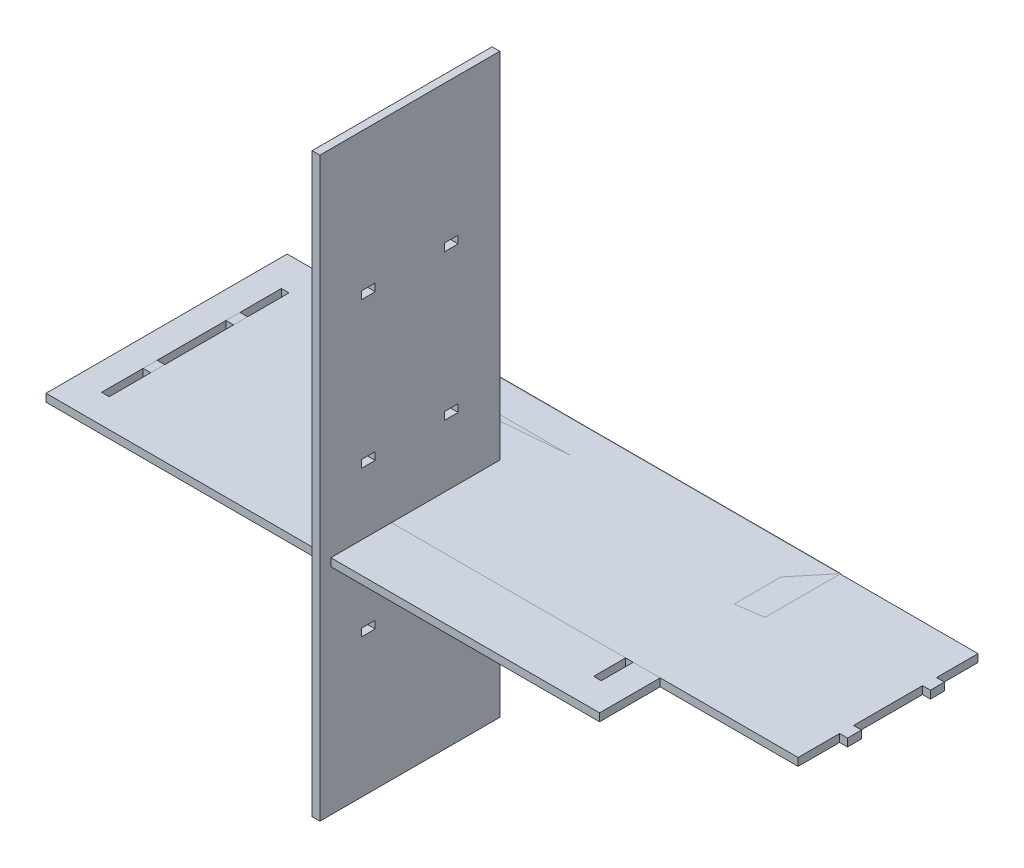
from build123d import *

# Parameters (mm, degrees)
SCHIZZO4_W                   = 130
SCHIZZO4_H                   = 416.834015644
SCHIZZO4_W_2                 = 9.9
SCHIZZO4_H_2                 = 5.5
ESTRUSIONE_ESTRUSIONE1_DEPTH = 5.6
ESTRUSIONE_ESTRUSIONE2_DEPTH = 5.6
ESTRUSIONE_ESTRUSIONE3_DEPTH = 5.6
SCHIZZO8_W                   = 400
SCHIZZO8_H                   = 174.270709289
SCHIZZO8_W_2                 = 350
SCHIZZO8_H_2                 = 129.9
ESTRUSIONE_ESTRUSIONE4_DEPTH = 5.6


with BuildPart() as part:
    # Schizzo4 → Estrusione-Estrusione1 (new body)
    with BuildSketch(Plane(origin=(0, 0, 0), x_dir=(0, 0, -1), z_dir=(1, 0, 0))):
        with Locations((-28.579812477, 53.046202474)):
            Rectangle(SCHIZZO4_W, SCHIZZO4_H)
        with Locations((1.370187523, 158.713210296)):
            Rectangle(SCHIZZO4_W_2, SCHIZZO4_H_2, mode=Mode.SUBTRACT)
        with Locations((-58.529812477, 158.713210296)):
            Rectangle(SCHIZZO4_W_2, SCHIZZO4_H_2, mode=Mode.SUBTRACT)
        with Locations((1.370187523, 53.213210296)):
            Rectangle(SCHIZZO4_W_2, SCHIZZO4_H_2, mode=Mode.SUBTRACT)
        with Locations((-58.529812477, 53.213210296)):
            Rectangle(SCHIZZO4_W_2, SCHIZZO4_H_2, mode=Mode.SUBTRACT)
        with Locations((1.370187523, -52.286789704)):
            Rectangle(SCHIZZO4_W_2, SCHIZZO4_H_2, mode=Mode.SUBTRACT)
        with Locations((-58.529812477, -52.286789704)):
            Rectangle(SCHIZZO4_W_2, SCHIZZO4_H_2, mode=Mode.SUBTRACT)
    extrude(amount=ESTRUSIONE_ESTRUSIONE1_DEPTH)


with BuildPart() as body_2:
    # Schizzo5 → Estrusione-Estrusione2 (new body)
    with BuildSketch(Plane(origin=(0, 0, 0), x_dir=(1, 0, 0), z_dir=(0, 1, 0))):
        Polygon((-50.557601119, -11.881440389), (-56.257601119, -11.881440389), (-56.257601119, -1.781440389), (-50.557601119, -1.781440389), (-50.557601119, 48.018559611), (-56.257601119, 48.018559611), (-56.257601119, 58.118559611), (-50.557601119, 58.118559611), (-50.557601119, 88.118559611), (299.442398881, 88.118559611), (299.442398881, 58.118559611), (305.142398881, 58.118559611), (305.142398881, 48.018559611), (299.442398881, 48.018559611), (299.442398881, -1.781440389), (305.142398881, -1.781440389), (305.142398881, -11.881440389), (299.442398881, -11.881440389), (299.442398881, -41.881440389), (-50.557601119, -41.881440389), align=None)
    extrude(amount=ESTRUSIONE_ESTRUSIONE2_DEPTH)


with BuildPart() as body_3:
    # Schizzo6 → Estrusione-Estrusione3 (new body)
    with BuildSketch(Plane(origin=(0, 0, 0), x_dir=(1, 0, 0), z_dir=(0, 1, 0))):
        Polygon((-175, -35), (-180.7, -35), (-180.7, -24.9), (-175, -24.9), (-175, 24.9), (-180.7, 24.9), (-180.7, 35), (-175, 35), (-175, 65), (-55, 65), (-55, -65), (-175, -65), align=None)
    extrude(amount=ESTRUSIONE_ESTRUSIONE3_DEPTH)


with BuildPart() as body_4:
    # Schizzo8 → Estrusione-Estrusione4 (new body)
    # profile 1 of 2: a face of its own
    with BuildSketch(Plane(origin=(0, 0, 0), x_dir=(1, 0, 0), z_dir=(0, 1, 0))):
        with Locations((-0.2, 1.449645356)):
            Rectangle(SCHIZZO8_W, SCHIZZO8_H)
        Polygon((-180.7, -65), (-180.7, 64.9), (-175.2, 64.9), (174.8, 64.9), (180.3, 64.9), (180.3, -65), (174.8, -65), (-175.2, -65), align=None, mode=Mode.SUBTRACT)
    # profile 2 of 2: a face of its own
    with BuildSketch(Plane(origin=(0, 0, 0), x_dir=(1, 0, 0), z_dir=(0, 1, 0))):
        with Locations((-0.2, -0.05)):
            Rectangle(SCHIZZO8_W_2, SCHIZZO8_H_2)
    extrude(amount=ESTRUSIONE_ESTRUSIONE4_DEPTH)


solid = Compound([part.part, body_2.part, body_3.part, body_4.part])
